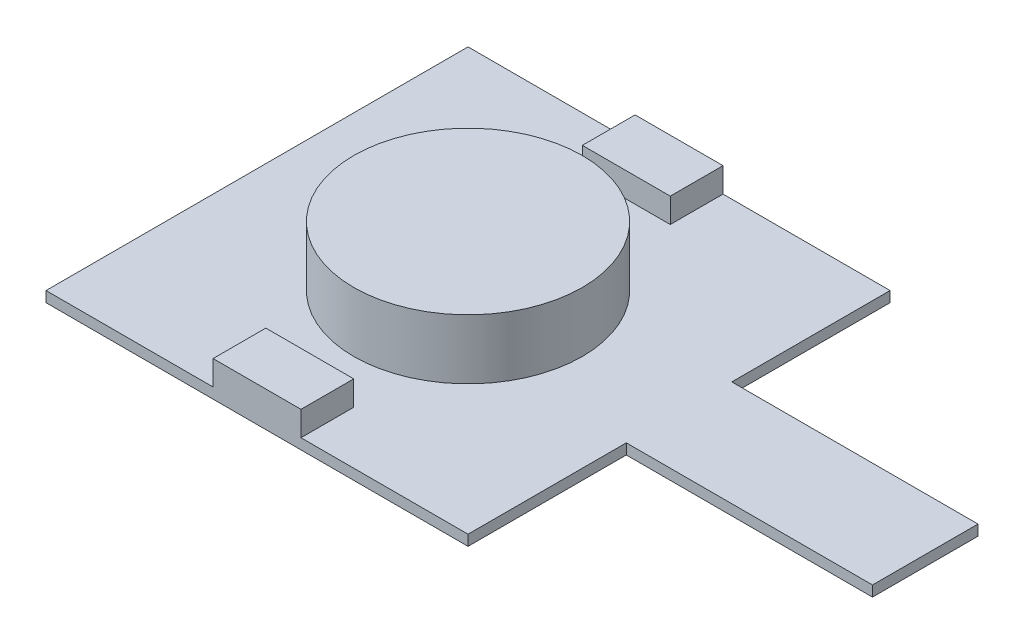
ISO-10303-21;
HEADER;
FILE_DESCRIPTION(('STEP AP214'),'2;1');
FILE_NAME('part.step','',(''),(''),'','','');
FILE_SCHEMA(('AUTOMOTIVE_DESIGN { 1 0 10303 214 1 1 1 1 }'));
ENDSEC;
DATA;
#1=APPLICATION_CONTEXT('core data for automotive mechanical design processes');
#2=APPLICATION_PROTOCOL_DEFINITION('international standard','automotive_design',2000,#1);
#3=PRODUCT_CONTEXT('',#1,'mechanical');
#4=PRODUCT('Part','Part','',(#3));
#5=PRODUCT_RELATED_PRODUCT_CATEGORY('part','',(#4));
#6=PRODUCT_DEFINITION_FORMATION('','',#4);
#7=PRODUCT_DEFINITION_CONTEXT('part definition',#1,'design');
#8=PRODUCT_DEFINITION('design','',#6,#7);
#9=PRODUCT_DEFINITION_SHAPE('','',#8);
#10=(LENGTH_UNIT() NAMED_UNIT(*) SI_UNIT(.MILLI.,.METRE.));
#11=(NAMED_UNIT(*) PLANE_ANGLE_UNIT() SI_UNIT($,.RADIAN.));
#12=(NAMED_UNIT(*) SI_UNIT($,.STERADIAN.) SOLID_ANGLE_UNIT());
#13=UNCERTAINTY_MEASURE_WITH_UNIT(LENGTH_MEASURE(1.E-05),#10,'distance_accuracy_value','');
#14=(GEOMETRIC_REPRESENTATION_CONTEXT(3) GLOBAL_UNCERTAINTY_ASSIGNED_CONTEXT((#13)) GLOBAL_UNIT_ASSIGNED_CONTEXT((#10,
#11,#12)) REPRESENTATION_CONTEXT('',''));
#15=CARTESIAN_POINT('',(0.,0.,0.));
#16=DIRECTION('',(0.,0.,1.));
#17=DIRECTION('',(1.,0.,0.));
#18=AXIS2_PLACEMENT_3D('',#15,#16,#17);
#19=CARTESIAN_POINT('',(0.,0.3,0.));
#20=DIRECTION('',(-1.,0.,0.));
#21=DIRECTION('',(0.,0.,1.));
#22=AXIS2_PLACEMENT_3D('',#19,#20,#21);
#23=PLANE('',#22);
#24=DIRECTION('',(0.,0.,-1.));
#25=VECTOR('',#24,1.);
#26=CARTESIAN_POINT('',(0.,0.,0.));
#27=LINE('',#26,#25);
#28=CARTESIAN_POINT('',(0.,0.,0.));
#29=VERTEX_POINT('',#28);
#30=CARTESIAN_POINT('',(0.,0.,-12.));
#31=VERTEX_POINT('',#30);
#32=EDGE_CURVE('E225',#29,#31,#27,.T.);
#33=ORIENTED_EDGE('',*,*,#32,.F.);
#34=DIRECTION('',(0.,-1.,0.));
#35=VECTOR('',#34,1.);
#36=CARTESIAN_POINT('',(0.,0.3,0.));
#37=LINE('',#36,#35);
#38=CARTESIAN_POINT('',(0.,0.3,0.));
#39=VERTEX_POINT('',#38);
#40=EDGE_CURVE('E57',#39,#29,#37,.T.);
#41=ORIENTED_EDGE('',*,*,#40,.F.);
#42=DIRECTION('',(0.,0.,-1.));
#43=VECTOR('',#42,1.);
#44=CARTESIAN_POINT('',(0.,0.3,0.));
#45=LINE('',#44,#43);
#46=CARTESIAN_POINT('',(0.,0.3,-12.));
#47=VERTEX_POINT('',#46);
#48=EDGE_CURVE('E189',#39,#47,#45,.T.);
#49=ORIENTED_EDGE('',*,*,#48,.T.);
#50=DIRECTION('',(0.,-1.,0.));
#51=VECTOR('',#50,1.);
#52=CARTESIAN_POINT('',(0.,0.3,-12.));
#53=LINE('',#52,#51);
#54=EDGE_CURVE('E11',#47,#31,#53,.T.);
#55=ORIENTED_EDGE('',*,*,#54,.T.);
#56=EDGE_LOOP('',(#33,#41,#49,#55));
#57=FACE_BOUND('',#56,.T.);
#58=ADVANCED_FACE('F49',(#57),#23,.T.);
#59=CARTESIAN_POINT('',(0.,0.3,0.));
#60=DIRECTION('',(0.,0.,-1.));
#61=DIRECTION('',(-1.,0.,0.));
#62=AXIS2_PLACEMENT_3D('',#59,#60,#61);
#63=PLANE('',#62);
#64=DIRECTION('',(1.,0.,0.));
#65=VECTOR('',#64,1.);
#66=CARTESIAN_POINT('',(0.,0.,0.));
#67=LINE('',#66,#65);
#68=CARTESIAN_POINT('',(12.,0.,0.));
#69=VERTEX_POINT('',#68);
#70=EDGE_CURVE('E228',#29,#69,#67,.T.);
#71=ORIENTED_EDGE('',*,*,#70,.T.);
#72=DIRECTION('',(0.,-1.,0.));
#73=VECTOR('',#72,1.);
#74=CARTESIAN_POINT('',(12.,0.3,0.));
#75=LINE('',#74,#73);
#76=CARTESIAN_POINT('',(12.,0.3,0.));
#77=VERTEX_POINT('',#76);
#78=EDGE_CURVE('E262',#77,#69,#75,.T.);
#79=ORIENTED_EDGE('',*,*,#78,.F.);
#80=DIRECTION('',(1.,0.,0.));
#81=VECTOR('',#80,1.);
#82=CARTESIAN_POINT('',(0.,0.3,0.));
#83=LINE('',#82,#81);
#84=CARTESIAN_POINT('',(7.25,0.3,0.));
#85=VERTEX_POINT('',#84);
#86=EDGE_CURVE('E196',#85,#77,#83,.T.);
#87=ORIENTED_EDGE('',*,*,#86,.F.);
#88=DIRECTION('',(0.,-1.,0.));
#89=VECTOR('',#88,1.);
#90=CARTESIAN_POINT('',(7.25,1.,0.));
#91=LINE('',#90,#89);
#92=CARTESIAN_POINT('',(7.25,1.,0.));
#93=VERTEX_POINT('',#92);
#94=EDGE_CURVE('E286',#93,#85,#91,.T.);
#95=ORIENTED_EDGE('',*,*,#94,.F.);
#96=DIRECTION('',(1.,0.,0.));
#97=VECTOR('',#96,1.);
#98=CARTESIAN_POINT('',(0.,1.,0.));
#99=LINE('',#98,#97);
#100=CARTESIAN_POINT('',(4.75,1.,0.));
#101=VERTEX_POINT('',#100);
#102=EDGE_CURVE('E394',#101,#93,#99,.T.);
#103=ORIENTED_EDGE('',*,*,#102,.F.);
#104=DIRECTION('',(0.,-1.,0.));
#105=VECTOR('',#104,1.);
#106=CARTESIAN_POINT('',(4.75,1.,0.));
#107=LINE('',#106,#105);
#108=CARTESIAN_POINT('',(4.75,0.3,0.));
#109=VERTEX_POINT('',#108);
#110=EDGE_CURVE('E229',#101,#109,#107,.T.);
#111=ORIENTED_EDGE('',*,*,#110,.T.);
#112=EDGE_CURVE('E192',#39,#109,#83,.T.);
#113=ORIENTED_EDGE('',*,*,#112,.F.);
#114=ORIENTED_EDGE('',*,*,#40,.T.);
#115=EDGE_LOOP('',(#71,#79,#87,#95,#103,#111,#113,#114));
#116=FACE_BOUND('',#115,.T.);
#117=ADVANCED_FACE('F268',(#116),#63,.F.);
#118=CARTESIAN_POINT('',(12.,0.3,0.));
#119=DIRECTION('',(-1.,0.,0.));
#120=DIRECTION('',(0.,0.,1.));
#121=AXIS2_PLACEMENT_3D('',#118,#119,#120);
#122=PLANE('',#121);
#123=DIRECTION('',(0.,0.,-1.));
#124=VECTOR('',#123,1.);
#125=CARTESIAN_POINT('',(12.,0.,0.));
#126=LINE('',#125,#124);
#127=CARTESIAN_POINT('',(12.,0.,-4.5));
#128=VERTEX_POINT('',#127);
#129=EDGE_CURVE('E232',#69,#128,#126,.T.);
#130=ORIENTED_EDGE('',*,*,#129,.T.);
#131=DIRECTION('',(0.,-1.,0.));
#132=VECTOR('',#131,1.);
#133=CARTESIAN_POINT('',(12.,0.3,-4.5));
#134=LINE('',#133,#132);
#135=CARTESIAN_POINT('',(12.,0.3,-4.5));
#136=VERTEX_POINT('',#135);
#137=EDGE_CURVE('E258',#136,#128,#134,.T.);
#138=ORIENTED_EDGE('',*,*,#137,.F.);
#139=DIRECTION('',(0.,0.,-1.));
#140=VECTOR('',#139,1.);
#141=CARTESIAN_POINT('',(12.,0.3,0.));
#142=LINE('',#141,#140);
#143=EDGE_CURVE('E205',#77,#136,#142,.T.);
#144=ORIENTED_EDGE('',*,*,#143,.F.);
#145=ORIENTED_EDGE('',*,*,#78,.T.);
#146=EDGE_LOOP('',(#130,#138,#144,#145));
#147=FACE_BOUND('',#146,.T.);
#148=ADVANCED_FACE('F277',(#147),#122,.F.);
#149=CARTESIAN_POINT('',(0.,0.3,-4.5));
#150=DIRECTION('',(0.,0.,-1.));
#151=DIRECTION('',(-1.,0.,0.));
#152=AXIS2_PLACEMENT_3D('',#149,#150,#151);
#153=PLANE('',#152);
#154=DIRECTION('',(1.,0.,0.));
#155=VECTOR('',#154,1.);
#156=CARTESIAN_POINT('',(0.,0.,-4.5));
#157=LINE('',#156,#155);
#158=CARTESIAN_POINT('',(19.,0.,-4.5));
#159=VERTEX_POINT('',#158);
#160=EDGE_CURVE('E236',#128,#159,#157,.T.);
#161=ORIENTED_EDGE('',*,*,#160,.T.);
#162=DIRECTION('',(0.,-1.,0.));
#163=VECTOR('',#162,1.);
#164=CARTESIAN_POINT('',(19.,0.3,-4.5));
#165=LINE('',#164,#163);
#166=CARTESIAN_POINT('',(19.,0.3,-4.5));
#167=VERTEX_POINT('',#166);
#168=EDGE_CURVE('E255',#167,#159,#165,.T.);
#169=ORIENTED_EDGE('',*,*,#168,.F.);
#170=DIRECTION('',(1.,0.,0.));
#171=VECTOR('',#170,1.);
#172=CARTESIAN_POINT('',(0.,0.3,-4.5));
#173=LINE('',#172,#171);
#174=EDGE_CURVE('E209',#136,#167,#173,.T.);
#175=ORIENTED_EDGE('',*,*,#174,.F.);
#176=ORIENTED_EDGE('',*,*,#137,.T.);
#177=EDGE_LOOP('',(#161,#169,#175,#176));
#178=FACE_BOUND('',#177,.T.);
#179=ADVANCED_FACE('F361',(#178),#153,.F.);
#180=CARTESIAN_POINT('',(19.,0.3,0.));
#181=DIRECTION('',(1.,0.,0.));
#182=DIRECTION('',(0.,0.,-1.));
#183=AXIS2_PLACEMENT_3D('',#180,#181,#182);
#184=PLANE('',#183);
#185=DIRECTION('',(0.,0.,1.));
#186=VECTOR('',#185,1.);
#187=CARTESIAN_POINT('',(19.,0.,0.));
#188=LINE('',#187,#186);
#189=CARTESIAN_POINT('',(19.,0.,-7.5));
#190=VERTEX_POINT('',#189);
#191=EDGE_CURVE('E240',#190,#159,#188,.T.);
#192=ORIENTED_EDGE('',*,*,#191,.F.);
#193=DIRECTION('',(0.,-1.,0.));
#194=VECTOR('',#193,1.);
#195=CARTESIAN_POINT('',(19.,0.3,-7.5));
#196=LINE('',#195,#194);
#197=CARTESIAN_POINT('',(19.,0.3,-7.5));
#198=VERTEX_POINT('',#197);
#199=EDGE_CURVE('E252',#198,#190,#196,.T.);
#200=ORIENTED_EDGE('',*,*,#199,.F.);
#201=DIRECTION('',(0.,0.,1.));
#202=VECTOR('',#201,1.);
#203=CARTESIAN_POINT('',(19.,0.3,0.));
#204=LINE('',#203,#202);
#205=EDGE_CURVE('E212',#198,#167,#204,.T.);
#206=ORIENTED_EDGE('',*,*,#205,.T.);
#207=ORIENTED_EDGE('',*,*,#168,.T.);
#208=EDGE_LOOP('',(#192,#200,#206,#207));
#209=FACE_BOUND('',#208,.T.);
#210=ADVANCED_FACE('F367',(#209),#184,.T.);
#211=CARTESIAN_POINT('',(0.,0.3,-7.5));
#212=DIRECTION('',(0.,0.,-1.));
#213=DIRECTION('',(-1.,0.,0.));
#214=AXIS2_PLACEMENT_3D('',#211,#212,#213);
#215=PLANE('',#214);
#216=DIRECTION('',(1.,0.,0.));
#217=VECTOR('',#216,1.);
#218=CARTESIAN_POINT('',(0.,0.,-7.5));
#219=LINE('',#218,#217);
#220=CARTESIAN_POINT('',(12.,0.,-7.5));
#221=VERTEX_POINT('',#220);
#222=EDGE_CURVE('E244',#221,#190,#219,.T.);
#223=ORIENTED_EDGE('',*,*,#222,.F.);
#224=DIRECTION('',(0.,-1.,0.));
#225=VECTOR('',#224,1.);
#226=CARTESIAN_POINT('',(12.,0.3,-7.5));
#227=LINE('',#226,#225);
#228=CARTESIAN_POINT('',(12.,0.3,-7.5));
#229=VERTEX_POINT('',#228);
#230=EDGE_CURVE('E101',#229,#221,#227,.T.);
#231=ORIENTED_EDGE('',*,*,#230,.F.);
#232=DIRECTION('',(1.,0.,0.));
#233=VECTOR('',#232,1.);
#234=CARTESIAN_POINT('',(0.,0.3,-7.5));
#235=LINE('',#234,#233);
#236=EDGE_CURVE('E216',#229,#198,#235,.T.);
#237=ORIENTED_EDGE('',*,*,#236,.T.);
#238=ORIENTED_EDGE('',*,*,#199,.T.);
#239=EDGE_LOOP('',(#223,#231,#237,#238));
#240=FACE_BOUND('',#239,.T.);
#241=ADVANCED_FACE('F371',(#240),#215,.T.);
#242=CARTESIAN_POINT('',(12.,0.,-12.));
#243=VERTEX_POINT('',#242);
#244=EDGE_CURVE('E224',#221,#243,#126,.T.);
#245=ORIENTED_EDGE('',*,*,#244,.T.);
#246=DIRECTION('',(0.,-1.,0.));
#247=VECTOR('',#246,1.);
#248=CARTESIAN_POINT('',(12.,0.3,-12.));
#249=LINE('',#248,#247);
#250=CARTESIAN_POINT('',(12.,0.3,-12.));
#251=VERTEX_POINT('',#250);
#252=EDGE_CURVE('E110',#251,#243,#249,.T.);
#253=ORIENTED_EDGE('',*,*,#252,.F.);
#254=EDGE_CURVE('E148',#229,#251,#142,.T.);
#255=ORIENTED_EDGE('',*,*,#254,.F.);
#256=ORIENTED_EDGE('',*,*,#230,.T.);
#257=EDGE_LOOP('',(#245,#253,#255,#256));
#258=FACE_BOUND('',#257,.T.);
#259=ADVANCED_FACE('F363',(#258),#122,.F.);
#260=CARTESIAN_POINT('',(0.,0.3,-12.));
#261=DIRECTION('',(0.,0.,-1.));
#262=DIRECTION('',(-1.,0.,0.));
#263=AXIS2_PLACEMENT_3D('',#260,#261,#262);
#264=PLANE('',#263);
#265=DIRECTION('',(1.,0.,0.));
#266=VECTOR('',#265,1.);
#267=CARTESIAN_POINT('',(0.,0.,-12.));
#268=LINE('',#267,#266);
#269=EDGE_CURVE('E187',#31,#243,#268,.T.);
#270=ORIENTED_EDGE('',*,*,#269,.F.);
#271=ORIENTED_EDGE('',*,*,#54,.F.);
#272=DIRECTION('',(1.,0.,0.));
#273=VECTOR('',#272,1.);
#274=CARTESIAN_POINT('',(0.,0.3,-12.));
#275=LINE('',#274,#273);
#276=CARTESIAN_POINT('',(4.75,0.3,-12.));
#277=VERTEX_POINT('',#276);
#278=EDGE_CURVE('E152',#47,#277,#275,.T.);
#279=ORIENTED_EDGE('',*,*,#278,.T.);
#280=DIRECTION('',(0.,-1.,0.));
#281=VECTOR('',#280,1.);
#282=CARTESIAN_POINT('',(4.75,1.,-12.));
#283=LINE('',#282,#281);
#284=CARTESIAN_POINT('',(4.75,1.,-12.));
#285=VERTEX_POINT('',#284);
#286=EDGE_CURVE('E179',#285,#277,#283,.T.);
#287=ORIENTED_EDGE('',*,*,#286,.F.);
#288=DIRECTION('',(1.,0.,0.));
#289=VECTOR('',#288,1.);
#290=CARTESIAN_POINT('',(0.,1.,-12.));
#291=LINE('',#290,#289);
#292=CARTESIAN_POINT('',(7.25,1.,-12.));
#293=VERTEX_POINT('',#292);
#294=EDGE_CURVE('E167',#285,#293,#291,.T.);
#295=ORIENTED_EDGE('',*,*,#294,.T.);
#296=DIRECTION('',(0.,-1.,0.));
#297=VECTOR('',#296,1.);
#298=CARTESIAN_POINT('',(7.25,1.,-12.));
#299=LINE('',#298,#297);
#300=CARTESIAN_POINT('',(7.25,0.3,-12.));
#301=VERTEX_POINT('',#300);
#302=EDGE_CURVE('E159',#293,#301,#299,.T.);
#303=ORIENTED_EDGE('',*,*,#302,.T.);
#304=EDGE_CURVE('E143',#301,#251,#275,.T.);
#305=ORIENTED_EDGE('',*,*,#304,.T.);
#306=ORIENTED_EDGE('',*,*,#252,.T.);
#307=EDGE_LOOP('',(#270,#271,#279,#287,#295,#303,#305,#306));
#308=FACE_BOUND('',#307,.T.);
#309=ADVANCED_FACE('F164',(#308),#264,.T.);
#310=CARTESIAN_POINT('',(0.,0.3,0.));
#311=DIRECTION('',(0.,1.,0.));
#312=DIRECTION('',(0.,0.,1.));
#313=AXIS2_PLACEMENT_3D('',#310,#311,#312);
#314=PLANE('',#313);
#315=CARTESIAN_POINT('',(6.,0.3,-6.));
#316=DIRECTION('',(0.,1.,0.));
#317=DIRECTION('',(0.,0.,1.));
#318=AXIS2_PLACEMENT_3D('',#315,#316,#317);
#319=CIRCLE('',#318,3.25);
#320=CARTESIAN_POINT('',(6.,0.3,-2.75));
#321=VERTEX_POINT('',#320);
#322=EDGE_CURVE('E183',#321,#321,#319,.T.);
#323=ORIENTED_EDGE('',*,*,#322,.F.);
#324=EDGE_LOOP('',(#323));
#325=FACE_BOUND('',#324,.T.);
#326=DIRECTION('',(0.,0.,1.));
#327=VECTOR('',#326,1.);
#328=CARTESIAN_POINT('',(4.74999999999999,0.3,0.));
#329=LINE('',#328,#327);
#330=CARTESIAN_POINT('',(4.75,0.3,-10.5));
#331=VERTEX_POINT('',#330);
#332=EDGE_CURVE('E114',#277,#331,#329,.T.);
#333=ORIENTED_EDGE('',*,*,#332,.F.);
#334=ORIENTED_EDGE('',*,*,#278,.F.);
#335=ORIENTED_EDGE('',*,*,#48,.F.);
#336=ORIENTED_EDGE('',*,*,#112,.T.);
#337=DIRECTION('',(0.,0.,-1.));
#338=VECTOR('',#337,1.);
#339=CARTESIAN_POINT('',(4.75,0.3,0.));
#340=LINE('',#339,#338);
#341=CARTESIAN_POINT('',(4.75,0.3,-1.5));
#342=VERTEX_POINT('',#341);
#343=EDGE_CURVE('E195',#109,#342,#340,.T.);
#344=ORIENTED_EDGE('',*,*,#343,.T.);
#345=DIRECTION('',(-1.,0.,0.));
#346=VECTOR('',#345,1.);
#347=CARTESIAN_POINT('',(0.,0.3,-1.5));
#348=LINE('',#347,#346);
#349=CARTESIAN_POINT('',(7.25,0.3,-1.5));
#350=VERTEX_POINT('',#349);
#351=EDGE_CURVE('E199',#350,#342,#348,.T.);
#352=ORIENTED_EDGE('',*,*,#351,.F.);
#353=DIRECTION('',(0.,0.,-1.));
#354=VECTOR('',#353,1.);
#355=CARTESIAN_POINT('',(7.25,0.3,0.));
#356=LINE('',#355,#354);
#357=EDGE_CURVE('E202',#85,#350,#356,.T.);
#358=ORIENTED_EDGE('',*,*,#357,.F.);
#359=ORIENTED_EDGE('',*,*,#86,.T.);
#360=ORIENTED_EDGE('',*,*,#143,.T.);
#361=ORIENTED_EDGE('',*,*,#174,.T.);
#362=ORIENTED_EDGE('',*,*,#205,.F.);
#363=ORIENTED_EDGE('',*,*,#236,.F.);
#364=ORIENTED_EDGE('',*,*,#254,.T.);
#365=ORIENTED_EDGE('',*,*,#304,.F.);
#366=DIRECTION('',(0.,0.,1.));
#367=VECTOR('',#366,1.);
#368=CARTESIAN_POINT('',(7.25000000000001,0.3,0.));
#369=LINE('',#368,#367);
#370=CARTESIAN_POINT('',(7.25,0.3,-10.5));
#371=VERTEX_POINT('',#370);
#372=EDGE_CURVE('E146',#301,#371,#369,.T.);
#373=ORIENTED_EDGE('',*,*,#372,.T.);
#374=DIRECTION('',(-1.,0.,0.));
#375=VECTOR('',#374,1.);
#376=CARTESIAN_POINT('',(0.,0.3,-10.5));
#377=LINE('',#376,#375);
#378=EDGE_CURVE('E65',#371,#331,#377,.T.);
#379=ORIENTED_EDGE('',*,*,#378,.T.);
#380=EDGE_LOOP('',(#333,#334,#335,#336,#344,#352,#358,#359,#360,#361,#362,#363,#364,#365,#373,#379));
#381=FACE_BOUND('',#380,.T.);
#382=ADVANCED_FACE('F145',(#325,#381),#314,.T.);
#383=CARTESIAN_POINT('',(0.,0.,0.));
#384=DIRECTION('',(0.,1.,0.));
#385=DIRECTION('',(0.,0.,1.));
#386=AXIS2_PLACEMENT_3D('',#383,#384,#385);
#387=PLANE('',#386);
#388=ORIENTED_EDGE('',*,*,#32,.T.);
#389=ORIENTED_EDGE('',*,*,#269,.T.);
#390=ORIENTED_EDGE('',*,*,#244,.F.);
#391=ORIENTED_EDGE('',*,*,#222,.T.);
#392=ORIENTED_EDGE('',*,*,#191,.T.);
#393=ORIENTED_EDGE('',*,*,#160,.F.);
#394=ORIENTED_EDGE('',*,*,#129,.F.);
#395=ORIENTED_EDGE('',*,*,#70,.F.);
#396=EDGE_LOOP('',(#388,#389,#390,#391,#392,#393,#394,#395));
#397=FACE_BOUND('',#396,.T.);
#398=ADVANCED_FACE('F274',(#397),#387,.F.);
#399=CARTESIAN_POINT('',(4.74999999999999,1.,0.));
#400=DIRECTION('',(1.,0.,0.));
#401=DIRECTION('',(0.,0.,-1.));
#402=AXIS2_PLACEMENT_3D('',#399,#400,#401);
#403=PLANE('',#402);
#404=ORIENTED_EDGE('',*,*,#332,.T.);
#405=DIRECTION('',(0.,-1.,0.));
#406=VECTOR('',#405,1.);
#407=CARTESIAN_POINT('',(4.75,1.,-10.5));
#408=LINE('',#407,#406);
#409=CARTESIAN_POINT('',(4.75,1.,-10.5));
#410=VERTEX_POINT('',#409);
#411=EDGE_CURVE('E171',#410,#331,#408,.T.);
#412=ORIENTED_EDGE('',*,*,#411,.F.);
#413=DIRECTION('',(0.,0.,1.));
#414=VECTOR('',#413,1.);
#415=CARTESIAN_POINT('',(4.74999999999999,1.,0.));
#416=LINE('',#415,#414);
#417=EDGE_CURVE('E313',#285,#410,#416,.T.);
#418=ORIENTED_EDGE('',*,*,#417,.F.);
#419=ORIENTED_EDGE('',*,*,#286,.T.);
#420=EDGE_LOOP('',(#404,#412,#418,#419));
#421=FACE_BOUND('',#420,.T.);
#422=ADVANCED_FACE('F341',(#421),#403,.F.);
#423=CARTESIAN_POINT('',(0.,1.,-10.5));
#424=DIRECTION('',(0.,0.,1.));
#425=DIRECTION('',(1.,0.,0.));
#426=AXIS2_PLACEMENT_3D('',#423,#424,#425);
#427=PLANE('',#426);
#428=ORIENTED_EDGE('',*,*,#411,.T.);
#429=ORIENTED_EDGE('',*,*,#378,.F.);
#430=DIRECTION('',(0.,-1.,0.));
#431=VECTOR('',#430,1.);
#432=CARTESIAN_POINT('',(7.25,1.,-10.5));
#433=LINE('',#432,#431);
#434=CARTESIAN_POINT('',(7.25,1.,-10.5));
#435=VERTEX_POINT('',#434);
#436=EDGE_CURVE('E162',#435,#371,#433,.T.);
#437=ORIENTED_EDGE('',*,*,#436,.F.);
#438=DIRECTION('',(-1.,0.,0.));
#439=VECTOR('',#438,1.);
#440=CARTESIAN_POINT('',(0.,1.,-10.5));
#441=LINE('',#440,#439);
#442=EDGE_CURVE('E173',#435,#410,#441,.T.);
#443=ORIENTED_EDGE('',*,*,#442,.T.);
#444=EDGE_LOOP('',(#428,#429,#437,#443));
#445=FACE_BOUND('',#444,.T.);
#446=ADVANCED_FACE('F320',(#445),#427,.T.);
#447=CARTESIAN_POINT('',(7.25000000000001,1.,0.));
#448=DIRECTION('',(1.,0.,0.));
#449=DIRECTION('',(0.,0.,-1.));
#450=AXIS2_PLACEMENT_3D('',#447,#448,#449);
#451=PLANE('',#450);
#452=ORIENTED_EDGE('',*,*,#436,.T.);
#453=ORIENTED_EDGE('',*,*,#372,.F.);
#454=ORIENTED_EDGE('',*,*,#302,.F.);
#455=DIRECTION('',(0.,0.,1.));
#456=VECTOR('',#455,1.);
#457=CARTESIAN_POINT('',(7.25000000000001,1.,0.));
#458=LINE('',#457,#456);
#459=EDGE_CURVE('E169',#293,#435,#458,.T.);
#460=ORIENTED_EDGE('',*,*,#459,.T.);
#461=EDGE_LOOP('',(#452,#453,#454,#460));
#462=FACE_BOUND('',#461,.T.);
#463=ADVANCED_FACE('F156',(#462),#451,.T.);
#464=CARTESIAN_POINT('',(0.,1.,0.));
#465=DIRECTION('',(0.,1.,0.));
#466=DIRECTION('',(0.,0.,1.));
#467=AXIS2_PLACEMENT_3D('',#464,#465,#466);
#468=PLANE('',#467);
#469=ORIENTED_EDGE('',*,*,#294,.F.);
#470=ORIENTED_EDGE('',*,*,#417,.T.);
#471=ORIENTED_EDGE('',*,*,#442,.F.);
#472=ORIENTED_EDGE('',*,*,#459,.F.);
#473=EDGE_LOOP('',(#469,#470,#471,#472));
#474=FACE_BOUND('',#473,.T.);
#475=ADVANCED_FACE('F326',(#474),#468,.T.);
#476=CARTESIAN_POINT('',(4.75,1.,0.));
#477=DIRECTION('',(-1.,0.,0.));
#478=DIRECTION('',(0.,0.,1.));
#479=AXIS2_PLACEMENT_3D('',#476,#477,#478);
#480=PLANE('',#479);
#481=DIRECTION('',(0.,-1.,0.));
#482=VECTOR('',#481,1.);
#483=CARTESIAN_POINT('',(4.75,1.,-1.5));
#484=LINE('',#483,#482);
#485=CARTESIAN_POINT('',(4.75,1.,-1.5));
#486=VERTEX_POINT('',#485);
#487=EDGE_CURVE('E305',#486,#342,#484,.T.);
#488=ORIENTED_EDGE('',*,*,#487,.T.);
#489=ORIENTED_EDGE('',*,*,#343,.F.);
#490=ORIENTED_EDGE('',*,*,#110,.F.);
#491=DIRECTION('',(0.,0.,-1.));
#492=VECTOR('',#491,1.);
#493=CARTESIAN_POINT('',(4.75,1.,0.));
#494=LINE('',#493,#492);
#495=EDGE_CURVE('E182',#101,#486,#494,.T.);
#496=ORIENTED_EDGE('',*,*,#495,.T.);
#497=EDGE_LOOP('',(#488,#489,#490,#496));
#498=FACE_BOUND('',#497,.T.);
#499=ADVANCED_FACE('F402',(#498),#480,.T.);
#500=CARTESIAN_POINT('',(7.25,1.,0.));
#501=DIRECTION('',(-1.,0.,0.));
#502=DIRECTION('',(0.,0.,1.));
#503=AXIS2_PLACEMENT_3D('',#500,#501,#502);
#504=PLANE('',#503);
#505=ORIENTED_EDGE('',*,*,#357,.T.);
#506=DIRECTION('',(0.,-1.,0.));
#507=VECTOR('',#506,1.);
#508=CARTESIAN_POINT('',(7.25,1.,-1.5));
#509=LINE('',#508,#507);
#510=CARTESIAN_POINT('',(7.25,1.,-1.5));
#511=VERTEX_POINT('',#510);
#512=EDGE_CURVE('E295',#511,#350,#509,.T.);
#513=ORIENTED_EDGE('',*,*,#512,.F.);
#514=DIRECTION('',(0.,0.,-1.));
#515=VECTOR('',#514,1.);
#516=CARTESIAN_POINT('',(7.25,1.,0.));
#517=LINE('',#516,#515);
#518=EDGE_CURVE('E397',#93,#511,#517,.T.);
#519=ORIENTED_EDGE('',*,*,#518,.F.);
#520=ORIENTED_EDGE('',*,*,#94,.T.);
#521=EDGE_LOOP('',(#505,#513,#519,#520));
#522=FACE_BOUND('',#521,.T.);
#523=ADVANCED_FACE('F293',(#522),#504,.F.);
#524=CARTESIAN_POINT('',(0.,1.,-1.5));
#525=DIRECTION('',(0.,0.,1.));
#526=DIRECTION('',(1.,0.,0.));
#527=AXIS2_PLACEMENT_3D('',#524,#525,#526);
#528=PLANE('',#527);
#529=ORIENTED_EDGE('',*,*,#351,.T.);
#530=ORIENTED_EDGE('',*,*,#487,.F.);
#531=DIRECTION('',(-1.,0.,0.));
#532=VECTOR('',#531,1.);
#533=CARTESIAN_POINT('',(0.,1.,-1.5));
#534=LINE('',#533,#532);
#535=EDGE_CURVE('E304',#511,#486,#534,.T.);
#536=ORIENTED_EDGE('',*,*,#535,.F.);
#537=ORIENTED_EDGE('',*,*,#512,.T.);
#538=EDGE_LOOP('',(#529,#530,#536,#537));
#539=FACE_BOUND('',#538,.T.);
#540=ADVANCED_FACE('F300',(#539),#528,.F.);
#541=CARTESIAN_POINT('',(0.,1.,0.));
#542=DIRECTION('',(0.,1.,0.));
#543=DIRECTION('',(0.,0.,1.));
#544=AXIS2_PLACEMENT_3D('',#541,#542,#543);
#545=PLANE('',#544);
#546=ORIENTED_EDGE('',*,*,#495,.F.);
#547=ORIENTED_EDGE('',*,*,#102,.T.);
#548=ORIENTED_EDGE('',*,*,#518,.T.);
#549=ORIENTED_EDGE('',*,*,#535,.T.);
#550=EDGE_LOOP('',(#546,#547,#548,#549));
#551=FACE_BOUND('',#550,.T.);
#552=ADVANCED_FACE('F384',(#551),#545,.T.);
#553=CARTESIAN_POINT('',(6.,2.,-6.));
#554=DIRECTION('',(0.,-1.,0.));
#555=DIRECTION('',(0.,0.,-1.));
#556=AXIS2_PLACEMENT_3D('',#553,#554,#555);
#557=CYLINDRICAL_SURFACE('',#556,3.25);
#558=ORIENTED_EDGE('',*,*,#322,.T.);
#559=EDGE_LOOP('',(#558));
#560=FACE_BOUND('',#559,.T.);
#561=CARTESIAN_POINT('',(6.,2.,-6.));
#562=DIRECTION('',(0.,1.,0.));
#563=DIRECTION('',(0.,0.,1.));
#564=AXIS2_PLACEMENT_3D('',#561,#562,#563);
#565=CIRCLE('',#564,3.25);
#566=CARTESIAN_POINT('',(6.,2.,-2.75));
#567=VERTEX_POINT('',#566);
#568=EDGE_CURVE('E314',#567,#567,#565,.T.);
#569=ORIENTED_EDGE('',*,*,#568,.F.);
#570=EDGE_LOOP('',(#569));
#571=FACE_BOUND('',#570,.T.);
#572=ADVANCED_FACE('F380',(#560,#571),#557,.T.);
#573=CARTESIAN_POINT('',(0.,2.,0.));
#574=DIRECTION('',(0.,1.,0.));
#575=DIRECTION('',(0.,0.,1.));
#576=AXIS2_PLACEMENT_3D('',#573,#574,#575);
#577=PLANE('',#576);
#578=ORIENTED_EDGE('',*,*,#568,.T.);
#579=EDGE_LOOP('',(#578));
#580=FACE_BOUND('',#579,.T.);
#581=ADVANCED_FACE('F383',(#580),#577,.T.);
#582=CLOSED_SHELL('',(#58,#117,#148,#179,#210,#241,#259,#309,#382,#398,#422,#446,#463,#475,#499,
#523,#540,#552,#572,#581));
#583=MANIFOLD_SOLID_BREP('B2',#582);
#584=ADVANCED_BREP_SHAPE_REPRESENTATION('',(#18,#583),#14);
#585=SHAPE_DEFINITION_REPRESENTATION(#9,#584);
ENDSEC;
END-ISO-10303-21;
